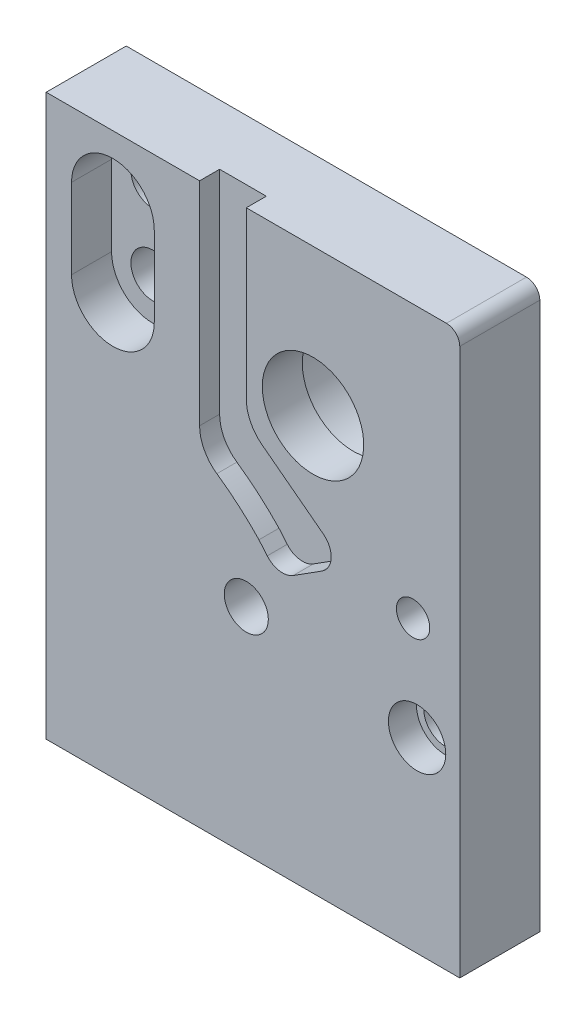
from build123d import *

# Parameters (mm, degrees)
SKETCH1_W              = 31
SKETCH1_H              = 42
BOSS_EXTRUDE1_DEPTH    = 6
FILLET1_R              = 1
ESBO_O1_R              = 1.3
CORTE_EXTRUS_O1_DEPTH  = 8
CORTE_EXTRUS_O2_REACH  = 54.545
ESBO_O2_R              = 1.65
ESBO_O2_3_R            = 1.65
CORTE_EXTRUS_O3_DEPTH  = 3
CORTE_EXTRUS_O4_REACH  = 54.545
ESBO_O3_R              = 1.6
ESBO_O3_3_R            = 2.15
ESBO_O3_3_R_2          = 1.6
CORTE_EXTRUS_O5_DEPTH  = 2.1
CORTE_EXTRUS_O6_REACH  = 54.545
ESBO_O4_R              = 3.8
ESBO_O4_3_R            = 4.55
ESBO_O4_3_R_2          = 3.8
CORTE_EXTRUS_O7_DEPTH  = 3
CORTE_EXTRUS_O9_REACH  = 54.545
ESBO_O6_R              = 1.65
ESBO_O6_R_2            = 1.25
CORTE_EXTRUS_O10_DEPTH = 1.5
FILLET2_R              = 1.5


with BuildPart() as part:
    # Sketch1 → Boss-Extrude1 (new body)
    with BuildSketch(Plane.XY):
        with Locations((15.5, 21)):
            Rectangle(SKETCH1_W, SKETCH1_H)
    extrude(amount=BOSS_EXTRUDE1_DEPTH)

    # Fillet1
    fillet1_edges = [part.edges().sort_by_distance(p)[0] for p in [
        (31, 42, 3),
    ]]
    fillet(fillet1_edges, radius=FILLET1_R)

    # Esbo_o1 → Corte-extrus_o1 (cut)
    with BuildSketch(Plane.XZ):
        with Locations(Location((17.6, 3, 0), (0, 0, 270))):
            Circle(ESBO_O1_R)
        with Locations(Location((9, 3, 0), (0, 0, 270))):
            Circle(ESBO_O1_R)
    extrude(amount=-CORTE_EXTRUS_O1_DEPTH, mode=Mode.SUBTRACT)

    # Esbo_o2 → Corte-extrus_o2 (cut, up to next)
    with BuildSketch(Plane.XY.offset(6), mode=Mode.PRIVATE) as corte_extrus_o2_sk1:
        with Locations((5, 31.1)):
            Circle(ESBO_O2_R)
    corte_extrus_o2_tool1 = extrude(corte_extrus_o2_sk1.sketch, amount=-CORTE_EXTRUS_O2_REACH, mode=Mode.PRIVATE) & part.part
    # Esbo_o2 → Corte-extrus_o2 (cut, up to next)
    with BuildSketch(Plane.XY.offset(6), mode=Mode.PRIVATE) as corte_extrus_o2_sk2:
        with Locations((5, 37.1)):
            Circle(ESBO_O2_R)
    corte_extrus_o2_tool2 = extrude(corte_extrus_o2_sk2.sketch, amount=-CORTE_EXTRUS_O2_REACH, mode=Mode.PRIVATE) & part.part
    add(corte_extrus_o2_tool1.solids().sort_by_distance((5, 31.1, 6))[0], mode=Mode.SUBTRACT)
    add(corte_extrus_o2_tool2.solids().sort_by_distance((5, 37.1, 6))[0], mode=Mode.SUBTRACT)

    # Esbo_o2_3 → Corte-extrus_o3 (cut)
    with BuildSketch(Plane.XY.offset(6)):
        with BuildLine():
            Line((8.1, 31.1), (8.1, 37.1))
            ThreePointArc((8.1, 37.1), (5, 40.2), (1.9, 37.1))
            Line((1.9, 37.1), (1.9, 31.1))
            ThreePointArc((1.9, 31.1), (5, 28), (8.1, 31.1))
        make_face()
        with Locations((5, 31.1)):
            Circle(ESBO_O2_3_R, mode=Mode.SUBTRACT)
        with Locations((5, 37.1)):
            Circle(ESBO_O2_3_R, mode=Mode.SUBTRACT)
    extrude(amount=-CORTE_EXTRUS_O3_DEPTH, mode=Mode.SUBTRACT)

    # Esbo_o3 → Corte-extrus_o4 (cut, up to next)
    with BuildSketch(Plane.XY.offset(6), mode=Mode.PRIVATE) as corte_extrus_o4_sk1:
        with Locations((27.8, 14)):
            Circle(ESBO_O3_R)
    corte_extrus_o4_tool1 = extrude(corte_extrus_o4_sk1.sketch, amount=-CORTE_EXTRUS_O4_REACH, mode=Mode.PRIVATE) & part.part
    add(corte_extrus_o4_tool1.solids().sort_by_distance((27.8, 14, 6))[0], mode=Mode.SUBTRACT)

    # Esbo_o3_3 → Corte-extrus_o5 (cut)
    with BuildSketch(Plane.XY.offset(6)):
        with Locations((27.8, 14)):
            Circle(ESBO_O3_3_R)
        with Locations((27.8, 14)):
            Circle(ESBO_O3_3_R_2, mode=Mode.SUBTRACT)
    extrude(amount=-CORTE_EXTRUS_O5_DEPTH, mode=Mode.SUBTRACT)

    # Esbo_o4 → Corte-extrus_o6 (cut, up to next)
    with BuildSketch(Plane(origin=(0, 0, 0), x_dir=(-1, 0, 0), z_dir=(0, 0, -1)), mode=Mode.PRIVATE) as corte_extrus_o6_sk1:
        with Locations((-20, 31)):
            Circle(ESBO_O4_R)
    corte_extrus_o6_tool1 = extrude(corte_extrus_o6_sk1.sketch, amount=-CORTE_EXTRUS_O6_REACH, mode=Mode.PRIVATE) & part.part
    add(corte_extrus_o6_tool1.solids().sort_by_distance((20, 31, 0))[0], mode=Mode.SUBTRACT)

    # Esbo_o4_3 → Corte-extrus_o7 (cut)
    with BuildSketch(Plane(origin=(0, 0, 0), x_dir=(-1, 0, 0), z_dir=(0, 0, -1))):
        with Locations((-20, 31)):
            Circle(ESBO_O4_3_R)
        with Locations((-20, 31)):
            Circle(ESBO_O4_3_R_2, mode=Mode.SUBTRACT)
    extrude(amount=-CORTE_EXTRUS_O7_DEPTH, mode=Mode.SUBTRACT)

    # Esbo_o6 → Corte-extrus_o9 (cut, up to next)
    with BuildSketch(Plane.XY.offset(6), mode=Mode.PRIVATE) as corte_extrus_o9_sk1:
        with Locations((15, 16.1)):
            Circle(ESBO_O6_R)
    corte_extrus_o9_tool1 = extrude(corte_extrus_o9_sk1.sketch, amount=-CORTE_EXTRUS_O9_REACH, mode=Mode.PRIVATE) & part.part
    # Esbo_o6 → Corte-extrus_o9 (cut, up to next)
    with BuildSketch(Plane.XY.offset(6), mode=Mode.PRIVATE) as corte_extrus_o9_sk2:
        with Locations((27.5, 21.6)):
            Circle(ESBO_O6_R_2)
    corte_extrus_o9_tool2 = extrude(corte_extrus_o9_sk2.sketch, amount=-CORTE_EXTRUS_O9_REACH, mode=Mode.PRIVATE) & part.part
    add(corte_extrus_o9_tool1.solids().sort_by_distance((15, 16.1, 6))[0], mode=Mode.SUBTRACT)
    add(corte_extrus_o9_tool2.solids().sort_by_distance((27.5, 21.6, 6))[0], mode=Mode.SUBTRACT)

    # Esbo_o7 → Corte-extrus_o10 (cut)
    with BuildSketch(Plane.XY.offset(6)):
        with BuildLine():
            Line((16.183449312, 27.199561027), (20.575717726, 23.857660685))
            Line((20.575717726, 23.857660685), (22.486963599, 22.403470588))
            Line((22.486963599, 22.403470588), (17.4113737, 19.184483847))
            Line((17.4113737, 19.184483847), (15.947598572, 20.922464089))
            ThreePointArc((15.947598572, 20.922464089), (14.440581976, 22.360267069), (12.792202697, 23.633539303))
            ThreePointArc((12.792202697, 23.633539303), (11.842614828, 24.707770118), (11.5, 26.1))
            Line((11.5, 26.1), (11.5, 39.1))
            Line((11.5, 39.1), (11.5, 42))
            Line((11.5, 42), (15, 42))
            Line((15, 42), (15, 39.1))
            Line((15, 39.1), (15, 29.587058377))
            ThreePointArc((15, 29.587058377), (15.31209635, 28.254701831), (16.183449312, 27.199561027))
        make_face()
    extrude(amount=-CORTE_EXTRUS_O10_DEPTH, mode=Mode.SUBTRACT)

    # Fillet2
    fillet2_edges = [part.edges().sort_by_distance(p)[0] for p in [
        (22.486963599, 22.403470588, 5.25),
        (17.4113737, 19.184483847, 5.25),
    ]]
    fillet(fillet2_edges, radius=FILLET2_R)


solid = part.part
